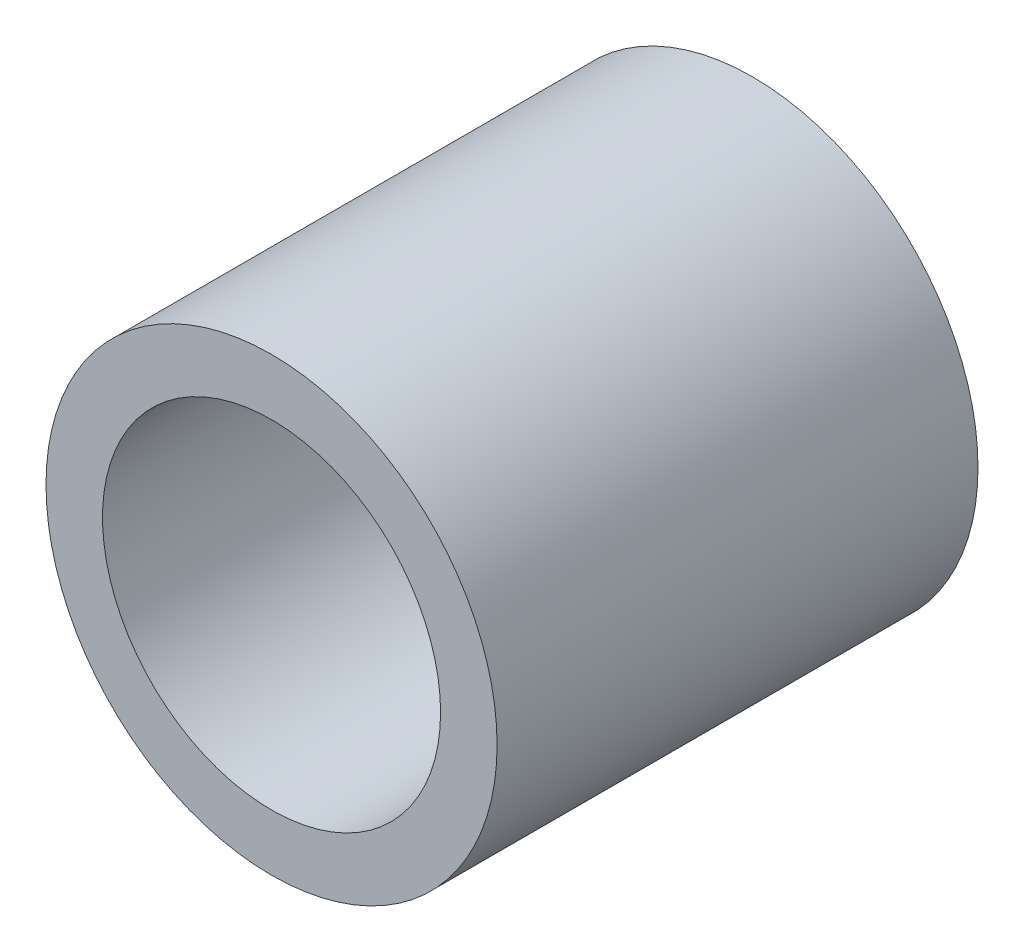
from build123d import *

# Parameters (mm, degrees)
SKETCH2_R          = 5.9563
SKETCH2_R_2        = 4.46405
BASE_EXTRUDE_DEPTH = 6.35


with BuildPart() as part:
    # Sketch2 → Base-Extrude (new, symmetric)
    with BuildSketch(Plane.XY):
        Circle(SKETCH2_R)
        Circle(SKETCH2_R_2, mode=Mode.SUBTRACT)
    extrude(amount=BASE_EXTRUDE_DEPTH, both=True)


solid = part.part
